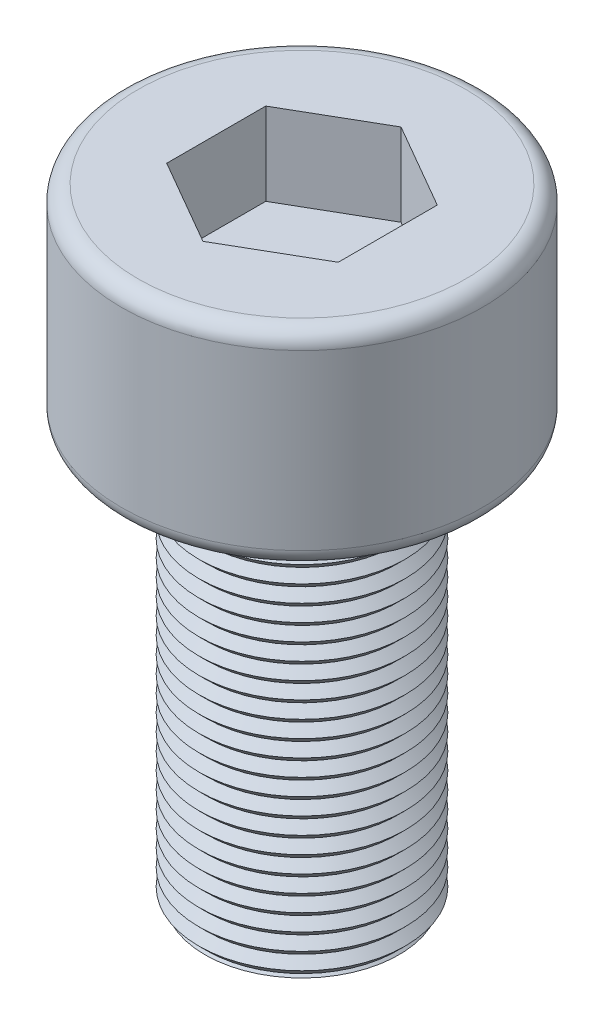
ISO-10303-21;
HEADER;
FILE_DESCRIPTION(('STEP AP214'),'2;1');
FILE_NAME('part.step','',(''),(''),'','','');
FILE_SCHEMA(('AUTOMOTIVE_DESIGN { 1 0 10303 214 1 1 1 1 }'));
ENDSEC;
DATA;
#1=APPLICATION_CONTEXT('core data for automotive mechanical design processes');
#2=APPLICATION_PROTOCOL_DEFINITION('international standard','automotive_design',2000,#1);
#3=PRODUCT_CONTEXT('',#1,'mechanical');
#4=PRODUCT('Part','Part','',(#3));
#5=PRODUCT_RELATED_PRODUCT_CATEGORY('part','',(#4));
#6=PRODUCT_DEFINITION_FORMATION('','',#4);
#7=PRODUCT_DEFINITION_CONTEXT('part definition',#1,'design');
#8=PRODUCT_DEFINITION('design','',#6,#7);
#9=PRODUCT_DEFINITION_SHAPE('','',#8);
#10=(LENGTH_UNIT() NAMED_UNIT(*) SI_UNIT(.MILLI.,.METRE.));
#11=(NAMED_UNIT(*) PLANE_ANGLE_UNIT() SI_UNIT($,.RADIAN.));
#12=(NAMED_UNIT(*) SI_UNIT($,.STERADIAN.) SOLID_ANGLE_UNIT());
#13=UNCERTAINTY_MEASURE_WITH_UNIT(LENGTH_MEASURE(1.E-05),#10,'distance_accuracy_value','');
#14=(GEOMETRIC_REPRESENTATION_CONTEXT(3) GLOBAL_UNCERTAINTY_ASSIGNED_CONTEXT((#13)) GLOBAL_UNIT_ASSIGNED_CONTEXT((#10,
#11,#12)) REPRESENTATION_CONTEXT('',''));
#15=CARTESIAN_POINT('',(0.,0.,0.));
#16=DIRECTION('',(0.,0.,1.));
#17=DIRECTION('',(1.,0.,0.));
#18=AXIS2_PLACEMENT_3D('',#15,#16,#17);
#19=CARTESIAN_POINT('',(0.,6.34998730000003,0.));
#20=DIRECTION('',(0.,1.,0.));
#21=DIRECTION('',(0.,0.,1.));
#22=AXIS2_PLACEMENT_3D('',#19,#20,#21);
#23=PLANE('',#22);
#24=CARTESIAN_POINT('',(0.,6.34998730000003,0.));
#25=DIRECTION('',(0.,1.,0.));
#26=DIRECTION('',(0.,0.,1.));
#27=AXIS2_PLACEMENT_3D('',#24,#25,#26);
#28=CIRCLE('',#27,2.52411944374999);
#29=CARTESIAN_POINT('',(0.,6.34998730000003,2.52411944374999));
#30=VERTEX_POINT('',#29);
#31=EDGE_CURVE('E46',#30,#30,#28,.F.);
#32=ORIENTED_EDGE('',*,*,#31,.T.);
#33=EDGE_LOOP('',(#32));
#34=FACE_BOUND('',#33,.T.);
#35=CARTESIAN_POINT('',(0.,6.34998730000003,0.));
#36=DIRECTION('',(0.,1.,0.));
#37=DIRECTION('',(0.,0.,1.));
#38=AXIS2_PLACEMENT_3D('',#35,#36,#37);
#39=CIRCLE('',#38,1.45860790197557);
#40=CARTESIAN_POINT('',(0.,6.34998730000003,1.45860790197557));
#41=VERTEX_POINT('',#40);
#42=EDGE_CURVE('E295',#41,#41,#39,.T.);
#43=ORIENTED_EDGE('',*,*,#42,.T.);
#44=EDGE_LOOP('',(#43));
#45=FACE_BOUND('',#44,.T.);
#46=ADVANCED_FACE('F38',(#34,#45),#23,.F.);
#47=CARTESIAN_POINT('',(0.,9.52498094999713,0.));
#48=DIRECTION('',(0.,1.,0.));
#49=DIRECTION('',(0.,0.,1.));
#50=AXIS2_PLACEMENT_3D('',#47,#48,#49);
#51=CYLINDRICAL_SURFACE('',#50,1.45860790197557);
#52=ORIENTED_EDGE('',*,*,#42,.F.);
#53=EDGE_LOOP('',(#52));
#54=FACE_BOUND('',#53,.T.);
#55=CARTESIAN_POINT('',(0.,6.22109837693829,0.));
#56=DIRECTION('',(0.,1.,0.));
#57=DIRECTION('',(0.,0.,1.));
#58=AXIS2_PLACEMENT_3D('',#55,#56,#57);
#59=CIRCLE('',#58,1.45860790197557);
#60=CARTESIAN_POINT('',(0.,6.22109837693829,1.45860790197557));
#61=VERTEX_POINT('',#60);
#62=EDGE_CURVE('E292',#61,#61,#59,.T.);
#63=ORIENTED_EDGE('',*,*,#62,.T.);
#64=EDGE_LOOP('',(#63));
#65=FACE_BOUND('',#64,.T.);
#66=ADVANCED_FACE('F344',(#54,#65),#51,.T.);
#67=CARTESIAN_POINT('',(0.,6.09220945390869,0.));
#68=DIRECTION('',(0.,-1.,0.));
#69=DIRECTION('',(0.,0.,-1.));
#70=AXIS2_PLACEMENT_3D('',#67,#68,#69);
#71=CONICAL_SURFACE('',#70,1.58749682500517,0.78539816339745);
#72=ORIENTED_EDGE('',*,*,#62,.F.);
#73=EDGE_LOOP('',(#72));
#74=FACE_BOUND('',#73,.T.);
#75=CARTESIAN_POINT('',(0.,6.09220945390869,0.));
#76=DIRECTION('',(0.,1.,0.));
#77=DIRECTION('',(0.,0.,1.));
#78=AXIS2_PLACEMENT_3D('',#75,#76,#77);
#79=CIRCLE('',#78,1.58749682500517);
#80=CARTESIAN_POINT('',(0.,6.09220945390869,1.58749682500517));
#81=VERTEX_POINT('',#80);
#82=EDGE_CURVE('E289',#81,#81,#79,.T.);
#83=ORIENTED_EDGE('',*,*,#82,.T.);
#84=EDGE_LOOP('',(#83));
#85=FACE_BOUND('',#84,.T.);
#86=ADVANCED_FACE('F349',(#74,#85),#71,.T.);
#87=CARTESIAN_POINT('',(0.,5.96332053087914,0.));
#88=DIRECTION('',(0.,1.,0.));
#89=DIRECTION('',(0.,0.,1.));
#90=AXIS2_PLACEMENT_3D('',#87,#88,#89);
#91=CONICAL_SURFACE('',#90,1.45860790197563,0.785398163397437);
#92=ORIENTED_EDGE('',*,*,#82,.F.);
#93=EDGE_LOOP('',(#92));
#94=FACE_BOUND('',#93,.T.);
#95=CARTESIAN_POINT('',(0.,5.96332053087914,0.));
#96=DIRECTION('',(0.,1.,0.));
#97=DIRECTION('',(0.,0.,1.));
#98=AXIS2_PLACEMENT_3D('',#95,#96,#97);
#99=CIRCLE('',#98,1.45860790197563);
#100=CARTESIAN_POINT('',(0.,5.96332053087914,1.45860790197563));
#101=VERTEX_POINT('',#100);
#102=EDGE_CURVE('E286',#101,#101,#99,.T.);
#103=ORIENTED_EDGE('',*,*,#102,.T.);
#104=EDGE_LOOP('',(#103));
#105=FACE_BOUND('',#104,.T.);
#106=ADVANCED_FACE('F355',(#94,#105),#91,.T.);
#107=CARTESIAN_POINT('',(0.,5.8344316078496,0.));
#108=DIRECTION('',(0.,-1.,0.));
#109=DIRECTION('',(0.,0.,-1.));
#110=AXIS2_PLACEMENT_3D('',#107,#108,#109);
#111=CONICAL_SURFACE('',#110,1.58749682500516,0.785398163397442);
#112=ORIENTED_EDGE('',*,*,#102,.F.);
#113=EDGE_LOOP('',(#112));
#114=FACE_BOUND('',#113,.T.);
#115=CARTESIAN_POINT('',(0.,5.8344316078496,0.));
#116=DIRECTION('',(0.,1.,0.));
#117=DIRECTION('',(0.,0.,1.));
#118=AXIS2_PLACEMENT_3D('',#115,#116,#117);
#119=CIRCLE('',#118,1.58749682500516);
#120=CARTESIAN_POINT('',(0.,5.8344316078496,1.58749682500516));
#121=VERTEX_POINT('',#120);
#122=EDGE_CURVE('E283',#121,#121,#119,.T.);
#123=ORIENTED_EDGE('',*,*,#122,.T.);
#124=EDGE_LOOP('',(#123));
#125=FACE_BOUND('',#124,.T.);
#126=ADVANCED_FACE('F359',(#114,#125),#111,.T.);
#127=CARTESIAN_POINT('',(0.,5.70554268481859,0.));
#128=DIRECTION('',(0.,1.,0.));
#129=DIRECTION('',(0.,0.,1.));
#130=AXIS2_PLACEMENT_3D('',#127,#128,#129);
#131=CONICAL_SURFACE('',#130,1.45860790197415,0.78539816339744);
#132=ORIENTED_EDGE('',*,*,#122,.F.);
#133=EDGE_LOOP('',(#132));
#134=FACE_BOUND('',#133,.T.);
#135=CARTESIAN_POINT('',(0.,5.70554268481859,0.));
#136=DIRECTION('',(0.,1.,0.));
#137=DIRECTION('',(0.,0.,1.));
#138=AXIS2_PLACEMENT_3D('',#135,#136,#137);
#139=CIRCLE('',#138,1.45860790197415);
#140=CARTESIAN_POINT('',(0.,5.70554268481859,1.45860790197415));
#141=VERTEX_POINT('',#140);
#142=EDGE_CURVE('E280',#141,#141,#139,.T.);
#143=ORIENTED_EDGE('',*,*,#142,.T.);
#144=EDGE_LOOP('',(#143));
#145=FACE_BOUND('',#144,.T.);
#146=ADVANCED_FACE('F363',(#134,#145),#131,.T.);
#147=CARTESIAN_POINT('',(0.,5.57665376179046,0.));
#148=DIRECTION('',(0.,-1.,0.));
#149=DIRECTION('',(0.,0.,-1.));
#150=AXIS2_PLACEMENT_3D('',#147,#148,#149);
#151=CONICAL_SURFACE('',#150,1.58749682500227,0.785398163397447);
#152=ORIENTED_EDGE('',*,*,#142,.F.);
#153=EDGE_LOOP('',(#152));
#154=FACE_BOUND('',#153,.T.);
#155=CARTESIAN_POINT('',(0.,5.57665376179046,0.));
#156=DIRECTION('',(0.,1.,0.));
#157=DIRECTION('',(0.,0.,1.));
#158=AXIS2_PLACEMENT_3D('',#155,#156,#157);
#159=CIRCLE('',#158,1.58749682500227);
#160=CARTESIAN_POINT('',(0.,5.57665376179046,1.58749682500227));
#161=VERTEX_POINT('',#160);
#162=EDGE_CURVE('E277',#161,#161,#159,.T.);
#163=ORIENTED_EDGE('',*,*,#162,.T.);
#164=EDGE_LOOP('',(#163));
#165=FACE_BOUND('',#164,.T.);
#166=ADVANCED_FACE('F367',(#154,#165),#151,.T.);
#167=CARTESIAN_POINT('',(0.,5.4477648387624,0.));
#168=DIRECTION('',(0.,1.,0.));
#169=DIRECTION('',(0.,0.,1.));
#170=AXIS2_PLACEMENT_3D('',#167,#168,#169);
#171=CONICAL_SURFACE('',#170,1.4586079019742,0.785398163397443);
#172=ORIENTED_EDGE('',*,*,#162,.F.);
#173=EDGE_LOOP('',(#172));
#174=FACE_BOUND('',#173,.T.);
#175=CARTESIAN_POINT('',(0.,5.4477648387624,0.));
#176=DIRECTION('',(0.,1.,0.));
#177=DIRECTION('',(0.,0.,1.));
#178=AXIS2_PLACEMENT_3D('',#175,#176,#177);
#179=CIRCLE('',#178,1.4586079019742);
#180=CARTESIAN_POINT('',(0.,5.4477648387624,1.4586079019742));
#181=VERTEX_POINT('',#180);
#182=EDGE_CURVE('E274',#181,#181,#179,.T.);
#183=ORIENTED_EDGE('',*,*,#182,.T.);
#184=EDGE_LOOP('',(#183));
#185=FACE_BOUND('',#184,.T.);
#186=ADVANCED_FACE('F371',(#174,#185),#171,.T.);
#187=CARTESIAN_POINT('',(0.,5.31887591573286,0.));
#188=DIRECTION('',(0.,-1.,0.));
#189=DIRECTION('',(0.,0.,-1.));
#190=AXIS2_PLACEMENT_3D('',#187,#188,#189);
#191=CONICAL_SURFACE('',#190,1.58749682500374,0.78539816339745);
#192=ORIENTED_EDGE('',*,*,#182,.F.);
#193=EDGE_LOOP('',(#192));
#194=FACE_BOUND('',#193,.T.);
#195=CARTESIAN_POINT('',(0.,5.31887591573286,0.));
#196=DIRECTION('',(0.,1.,0.));
#197=DIRECTION('',(0.,0.,1.));
#198=AXIS2_PLACEMENT_3D('',#195,#196,#197);
#199=CIRCLE('',#198,1.58749682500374);
#200=CARTESIAN_POINT('',(0.,5.31887591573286,1.58749682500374));
#201=VERTEX_POINT('',#200);
#202=EDGE_CURVE('E271',#201,#201,#199,.T.);
#203=ORIENTED_EDGE('',*,*,#202,.T.);
#204=EDGE_LOOP('',(#203));
#205=FACE_BOUND('',#204,.T.);
#206=ADVANCED_FACE('F375',(#194,#205),#191,.T.);
#207=CARTESIAN_POINT('',(0.,5.18998699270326,0.));
#208=DIRECTION('',(0.,1.,0.));
#209=DIRECTION('',(0.,0.,1.));
#210=AXIS2_PLACEMENT_3D('',#207,#208,#209);
#211=CONICAL_SURFACE('',#210,1.45860790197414,0.785398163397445);
#212=ORIENTED_EDGE('',*,*,#202,.F.);
#213=EDGE_LOOP('',(#212));
#214=FACE_BOUND('',#213,.T.);
#215=CARTESIAN_POINT('',(0.,5.18998699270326,0.));
#216=DIRECTION('',(0.,1.,0.));
#217=DIRECTION('',(0.,0.,1.));
#218=AXIS2_PLACEMENT_3D('',#215,#216,#217);
#219=CIRCLE('',#218,1.45860790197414);
#220=CARTESIAN_POINT('',(0.,5.18998699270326,1.45860790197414));
#221=VERTEX_POINT('',#220);
#222=EDGE_CURVE('E268',#221,#221,#219,.T.);
#223=ORIENTED_EDGE('',*,*,#222,.T.);
#224=EDGE_LOOP('',(#223));
#225=FACE_BOUND('',#224,.T.);
#226=ADVANCED_FACE('F379',(#214,#225),#211,.T.);
#227=CARTESIAN_POINT('',(0.,5.06109806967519,0.));
#228=DIRECTION('',(0.,-1.,0.));
#229=DIRECTION('',(0.,0.,-1.));
#230=AXIS2_PLACEMENT_3D('',#227,#228,#229);
#231=CONICAL_SURFACE('',#230,1.58749682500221,0.785398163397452);
#232=ORIENTED_EDGE('',*,*,#222,.F.);
#233=EDGE_LOOP('',(#232));
#234=FACE_BOUND('',#233,.T.);
#235=CARTESIAN_POINT('',(0.,5.06109806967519,0.));
#236=DIRECTION('',(0.,1.,0.));
#237=DIRECTION('',(0.,0.,1.));
#238=AXIS2_PLACEMENT_3D('',#235,#236,#237);
#239=CIRCLE('',#238,1.58749682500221);
#240=CARTESIAN_POINT('',(0.,5.06109806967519,1.58749682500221));
#241=VERTEX_POINT('',#240);
#242=EDGE_CURVE('E265',#241,#241,#239,.T.);
#243=ORIENTED_EDGE('',*,*,#242,.T.);
#244=EDGE_LOOP('',(#243));
#245=FACE_BOUND('',#244,.T.);
#246=ADVANCED_FACE('F383',(#234,#245),#231,.T.);
#247=CARTESIAN_POINT('',(0.,4.93220914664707,0.));
#248=DIRECTION('',(0.,1.,0.));
#249=DIRECTION('',(0.,0.,1.));
#250=AXIS2_PLACEMENT_3D('',#247,#248,#249);
#251=CONICAL_SURFACE('',#250,1.45860790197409,0.785398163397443);
#252=ORIENTED_EDGE('',*,*,#242,.F.);
#253=EDGE_LOOP('',(#252));
#254=FACE_BOUND('',#253,.T.);
#255=CARTESIAN_POINT('',(0.,4.93220914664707,0.));
#256=DIRECTION('',(0.,1.,0.));
#257=DIRECTION('',(0.,0.,1.));
#258=AXIS2_PLACEMENT_3D('',#255,#256,#257);
#259=CIRCLE('',#258,1.45860790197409);
#260=CARTESIAN_POINT('',(0.,4.93220914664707,1.45860790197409));
#261=VERTEX_POINT('',#260);
#262=EDGE_CURVE('E262',#261,#261,#259,.T.);
#263=ORIENTED_EDGE('',*,*,#262,.T.);
#264=EDGE_LOOP('',(#263));
#265=FACE_BOUND('',#264,.T.);
#266=ADVANCED_FACE('F387',(#254,#265),#251,.T.);
#267=CARTESIAN_POINT('',(0.,4.80332022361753,0.));
#268=DIRECTION('',(0.,-1.,0.));
#269=DIRECTION('',(0.,0.,-1.));
#270=AXIS2_PLACEMENT_3D('',#267,#268,#269);
#271=CONICAL_SURFACE('',#270,1.58749682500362,0.785398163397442);
#272=ORIENTED_EDGE('',*,*,#262,.F.);
#273=EDGE_LOOP('',(#272));
#274=FACE_BOUND('',#273,.T.);
#275=CARTESIAN_POINT('',(0.,4.80332022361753,0.));
#276=DIRECTION('',(0.,1.,0.));
#277=DIRECTION('',(0.,0.,1.));
#278=AXIS2_PLACEMENT_3D('',#275,#276,#277);
#279=CIRCLE('',#278,1.58749682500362);
#280=CARTESIAN_POINT('',(0.,4.80332022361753,1.58749682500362));
#281=VERTEX_POINT('',#280);
#282=EDGE_CURVE('E259',#281,#281,#279,.T.);
#283=ORIENTED_EDGE('',*,*,#282,.T.);
#284=EDGE_LOOP('',(#283));
#285=FACE_BOUND('',#284,.T.);
#286=ADVANCED_FACE('F391',(#274,#285),#271,.T.);
#287=CARTESIAN_POINT('',(0.,4.67443130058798,0.));
#288=DIRECTION('',(0.,1.,0.));
#289=DIRECTION('',(0.,0.,1.));
#290=AXIS2_PLACEMENT_3D('',#287,#288,#289);
#291=CONICAL_SURFACE('',#290,1.45860790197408,0.785398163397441);
#292=ORIENTED_EDGE('',*,*,#282,.F.);
#293=EDGE_LOOP('',(#292));
#294=FACE_BOUND('',#293,.T.);
#295=CARTESIAN_POINT('',(0.,4.67443130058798,0.));
#296=DIRECTION('',(0.,1.,0.));
#297=DIRECTION('',(0.,0.,1.));
#298=AXIS2_PLACEMENT_3D('',#295,#296,#297);
#299=CIRCLE('',#298,1.45860790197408);
#300=CARTESIAN_POINT('',(0.,4.67443130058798,1.45860790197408));
#301=VERTEX_POINT('',#300);
#302=EDGE_CURVE('E256',#301,#301,#299,.T.);
#303=ORIENTED_EDGE('',*,*,#302,.T.);
#304=EDGE_LOOP('',(#303));
#305=FACE_BOUND('',#304,.T.);
#306=ADVANCED_FACE('F395',(#294,#305),#291,.T.);
#307=CARTESIAN_POINT('',(0.,4.54554237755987,0.));
#308=DIRECTION('',(0.,-1.,0.));
#309=DIRECTION('',(0.,0.,-1.));
#310=AXIS2_PLACEMENT_3D('',#307,#308,#309);
#311=CONICAL_SURFACE('',#310,1.5874968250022,0.785398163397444);
#312=ORIENTED_EDGE('',*,*,#302,.F.);
#313=EDGE_LOOP('',(#312));
#314=FACE_BOUND('',#313,.T.);
#315=CARTESIAN_POINT('',(0.,4.54554237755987,0.));
#316=DIRECTION('',(0.,1.,0.));
#317=DIRECTION('',(0.,0.,1.));
#318=AXIS2_PLACEMENT_3D('',#315,#316,#317);
#319=CIRCLE('',#318,1.5874968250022);
#320=CARTESIAN_POINT('',(0.,4.54554237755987,1.5874968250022));
#321=VERTEX_POINT('',#320);
#322=EDGE_CURVE('E253',#321,#321,#319,.T.);
#323=ORIENTED_EDGE('',*,*,#322,.T.);
#324=EDGE_LOOP('',(#323));
#325=FACE_BOUND('',#324,.T.);
#326=ADVANCED_FACE('F399',(#314,#325),#311,.T.);
#327=CARTESIAN_POINT('',(0.,4.4166534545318,0.));
#328=DIRECTION('',(0.,1.,0.));
#329=DIRECTION('',(0.,0.,1.));
#330=AXIS2_PLACEMENT_3D('',#327,#328,#329);
#331=CONICAL_SURFACE('',#330,1.45860790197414,0.785398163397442);
#332=ORIENTED_EDGE('',*,*,#322,.F.);
#333=EDGE_LOOP('',(#332));
#334=FACE_BOUND('',#333,.T.);
#335=CARTESIAN_POINT('',(0.,4.4166534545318,0.));
#336=DIRECTION('',(0.,1.,0.));
#337=DIRECTION('',(0.,0.,1.));
#338=AXIS2_PLACEMENT_3D('',#335,#336,#337);
#339=CIRCLE('',#338,1.45860790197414);
#340=CARTESIAN_POINT('',(0.,4.4166534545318,1.45860790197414));
#341=VERTEX_POINT('',#340);
#342=EDGE_CURVE('E250',#341,#341,#339,.T.);
#343=ORIENTED_EDGE('',*,*,#342,.T.);
#344=EDGE_LOOP('',(#343));
#345=FACE_BOUND('',#344,.T.);
#346=ADVANCED_FACE('F403',(#334,#345),#331,.T.);
#347=CARTESIAN_POINT('',(0.,4.28776453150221,0.));
#348=DIRECTION('',(0.,-1.,0.));
#349=DIRECTION('',(0.,0.,-1.));
#350=AXIS2_PLACEMENT_3D('',#347,#348,#349);
#351=CONICAL_SURFACE('',#350,1.58749682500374,0.78539816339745);
#352=ORIENTED_EDGE('',*,*,#342,.F.);
#353=EDGE_LOOP('',(#352));
#354=FACE_BOUND('',#353,.T.);
#355=CARTESIAN_POINT('',(0.,4.28776453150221,0.));
#356=DIRECTION('',(0.,1.,0.));
#357=DIRECTION('',(0.,0.,1.));
#358=AXIS2_PLACEMENT_3D('',#355,#356,#357);
#359=CIRCLE('',#358,1.58749682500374);
#360=CARTESIAN_POINT('',(0.,4.28776453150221,1.58749682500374));
#361=VERTEX_POINT('',#360);
#362=EDGE_CURVE('E247',#361,#361,#359,.T.);
#363=ORIENTED_EDGE('',*,*,#362,.T.);
#364=EDGE_LOOP('',(#363));
#365=FACE_BOUND('',#364,.T.);
#366=ADVANCED_FACE('F407',(#354,#365),#351,.T.);
#367=CARTESIAN_POINT('',(0.,4.15887560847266,0.));
#368=DIRECTION('',(0.,1.,0.));
#369=DIRECTION('',(0.,0.,1.));
#370=AXIS2_PLACEMENT_3D('',#367,#368,#369);
#371=CONICAL_SURFACE('',#370,1.45860790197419,0.785398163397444);
#372=ORIENTED_EDGE('',*,*,#362,.F.);
#373=EDGE_LOOP('',(#372));
#374=FACE_BOUND('',#373,.T.);
#375=CARTESIAN_POINT('',(0.,4.15887560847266,0.));
#376=DIRECTION('',(0.,1.,0.));
#377=DIRECTION('',(0.,0.,1.));
#378=AXIS2_PLACEMENT_3D('',#375,#376,#377);
#379=CIRCLE('',#378,1.45860790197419);
#380=CARTESIAN_POINT('',(0.,4.15887560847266,1.45860790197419));
#381=VERTEX_POINT('',#380);
#382=EDGE_CURVE('E244',#381,#381,#379,.T.);
#383=ORIENTED_EDGE('',*,*,#382,.T.);
#384=EDGE_LOOP('',(#383));
#385=FACE_BOUND('',#384,.T.);
#386=ADVANCED_FACE('F411',(#374,#385),#371,.T.);
#387=CARTESIAN_POINT('',(0.,4.0299866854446,0.));
#388=DIRECTION('',(0.,-1.,0.));
#389=DIRECTION('',(0.,0.,-1.));
#390=AXIS2_PLACEMENT_3D('',#387,#388,#389);
#391=CONICAL_SURFACE('',#390,1.58749682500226,0.78539816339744);
#392=ORIENTED_EDGE('',*,*,#382,.F.);
#393=EDGE_LOOP('',(#392));
#394=FACE_BOUND('',#393,.T.);
#395=CARTESIAN_POINT('',(0.,4.0299866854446,0.));
#396=DIRECTION('',(0.,1.,0.));
#397=DIRECTION('',(0.,0.,1.));
#398=AXIS2_PLACEMENT_3D('',#395,#396,#397);
#399=CIRCLE('',#398,1.58749682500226);
#400=CARTESIAN_POINT('',(0.,4.0299866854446,1.58749682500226));
#401=VERTEX_POINT('',#400);
#402=EDGE_CURVE('E241',#401,#401,#399,.T.);
#403=ORIENTED_EDGE('',*,*,#402,.T.);
#404=EDGE_LOOP('',(#403));
#405=FACE_BOUND('',#404,.T.);
#406=ADVANCED_FACE('F415',(#394,#405),#391,.T.);
#407=CARTESIAN_POINT('',(0.,3.90109776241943,0.));
#408=DIRECTION('',(0.,1.,0.));
#409=DIRECTION('',(0.,0.,1.));
#410=AXIS2_PLACEMENT_3D('',#407,#408,#409);
#411=CONICAL_SURFACE('',#410,1.45860790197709,0.785398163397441);
#412=ORIENTED_EDGE('',*,*,#402,.F.);
#413=EDGE_LOOP('',(#412));
#414=FACE_BOUND('',#413,.T.);
#415=CARTESIAN_POINT('',(0.,3.90109776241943,0.));
#416=DIRECTION('',(0.,1.,0.));
#417=DIRECTION('',(0.,0.,1.));
#418=AXIS2_PLACEMENT_3D('',#415,#416,#417);
#419=CIRCLE('',#418,1.45860790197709);
#420=CARTESIAN_POINT('',(0.,3.90109776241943,1.45860790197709));
#421=VERTEX_POINT('',#420);
#422=EDGE_CURVE('E238',#421,#421,#419,.T.);
#423=ORIENTED_EDGE('',*,*,#422,.T.);
#424=EDGE_LOOP('',(#423));
#425=FACE_BOUND('',#424,.T.);
#426=ADVANCED_FACE('F419',(#414,#425),#411,.T.);
#427=CARTESIAN_POINT('',(0.,3.77220883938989,0.));
#428=DIRECTION('',(0.,-1.,0.));
#429=DIRECTION('',(0.,0.,-1.));
#430=AXIS2_PLACEMENT_3D('',#427,#428,#429);
#431=CONICAL_SURFACE('',#430,1.58749682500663,0.785398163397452);
#432=ORIENTED_EDGE('',*,*,#422,.F.);
#433=EDGE_LOOP('',(#432));
#434=FACE_BOUND('',#433,.T.);
#435=CARTESIAN_POINT('',(0.,3.77220883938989,0.));
#436=DIRECTION('',(0.,1.,0.));
#437=DIRECTION('',(0.,0.,1.));
#438=AXIS2_PLACEMENT_3D('',#435,#436,#437);
#439=CIRCLE('',#438,1.58749682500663);
#440=CARTESIAN_POINT('',(0.,3.77220883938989,1.58749682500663));
#441=VERTEX_POINT('',#440);
#442=EDGE_CURVE('E235',#441,#441,#439,.T.);
#443=ORIENTED_EDGE('',*,*,#442,.T.);
#444=EDGE_LOOP('',(#443));
#445=FACE_BOUND('',#444,.T.);
#446=ADVANCED_FACE('F423',(#434,#445),#431,.T.);
#447=CARTESIAN_POINT('',(0.,3.6433199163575,0.));
#448=DIRECTION('',(0.,1.,0.));
#449=DIRECTION('',(0.,0.,1.));
#450=AXIS2_PLACEMENT_3D('',#447,#448,#449);
#451=CONICAL_SURFACE('',#450,1.45860790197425,0.785398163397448);
#452=ORIENTED_EDGE('',*,*,#442,.F.);
#453=EDGE_LOOP('',(#452));
#454=FACE_BOUND('',#453,.T.);
#455=CARTESIAN_POINT('',(0.,3.6433199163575,0.));
#456=DIRECTION('',(0.,1.,0.));
#457=DIRECTION('',(0.,0.,1.));
#458=AXIS2_PLACEMENT_3D('',#455,#456,#457);
#459=CIRCLE('',#458,1.45860790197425);
#460=CARTESIAN_POINT('',(0.,3.6433199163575,1.45860790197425));
#461=VERTEX_POINT('',#460);
#462=EDGE_CURVE('E232',#461,#461,#459,.T.);
#463=ORIENTED_EDGE('',*,*,#462,.T.);
#464=EDGE_LOOP('',(#463));
#465=FACE_BOUND('',#464,.T.);
#466=ADVANCED_FACE('F427',(#454,#465),#451,.T.);
#467=CARTESIAN_POINT('',(0.,3.51443099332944,0.));
#468=DIRECTION('',(0.,-1.,0.));
#469=DIRECTION('',(0.,0.,-1.));
#470=AXIS2_PLACEMENT_3D('',#467,#468,#469);
#471=CONICAL_SURFACE('',#470,1.58749682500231,0.785398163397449);
#472=ORIENTED_EDGE('',*,*,#462,.F.);
#473=EDGE_LOOP('',(#472));
#474=FACE_BOUND('',#473,.T.);
#475=CARTESIAN_POINT('',(0.,3.51443099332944,0.));
#476=DIRECTION('',(0.,1.,0.));
#477=DIRECTION('',(0.,0.,1.));
#478=AXIS2_PLACEMENT_3D('',#475,#476,#477);
#479=CIRCLE('',#478,1.58749682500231);
#480=CARTESIAN_POINT('',(0.,3.51443099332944,1.58749682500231));
#481=VERTEX_POINT('',#480);
#482=EDGE_CURVE('E229',#481,#481,#479,.T.);
#483=ORIENTED_EDGE('',*,*,#482,.T.);
#484=EDGE_LOOP('',(#483));
#485=FACE_BOUND('',#484,.T.);
#486=ADVANCED_FACE('F431',(#474,#485),#471,.T.);
#487=CARTESIAN_POINT('',(0.,3.3855420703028,0.));
#488=DIRECTION('',(0.,1.,0.));
#489=DIRECTION('',(0.,0.,1.));
#490=AXIS2_PLACEMENT_3D('',#487,#488,#489);
#491=CONICAL_SURFACE('',#490,1.45860790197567,0.785398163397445);
#492=ORIENTED_EDGE('',*,*,#482,.F.);
#493=EDGE_LOOP('',(#492));
#494=FACE_BOUND('',#493,.T.);
#495=CARTESIAN_POINT('',(0.,3.3855420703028,0.));
#496=DIRECTION('',(0.,1.,0.));
#497=DIRECTION('',(0.,0.,1.));
#498=AXIS2_PLACEMENT_3D('',#495,#496,#497);
#499=CIRCLE('',#498,1.45860790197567);
#500=CARTESIAN_POINT('',(0.,3.3855420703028,1.45860790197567));
#501=VERTEX_POINT('',#500);
#502=EDGE_CURVE('E226',#501,#501,#499,.T.);
#503=ORIENTED_EDGE('',*,*,#502,.T.);
#504=EDGE_LOOP('',(#503));
#505=FACE_BOUND('',#504,.T.);
#506=ADVANCED_FACE('F435',(#494,#505),#491,.T.);
#507=CARTESIAN_POINT('',(0.,3.25665314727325,0.));
#508=DIRECTION('',(0.,-1.,0.));
#509=DIRECTION('',(0.,0.,-1.));
#510=AXIS2_PLACEMENT_3D('',#507,#508,#509);
#511=CONICAL_SURFACE('',#510,1.58749682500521,0.78539816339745);
#512=ORIENTED_EDGE('',*,*,#502,.F.);
#513=EDGE_LOOP('',(#512));
#514=FACE_BOUND('',#513,.T.);
#515=CARTESIAN_POINT('',(0.,3.25665314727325,0.));
#516=DIRECTION('',(0.,1.,0.));
#517=DIRECTION('',(0.,0.,1.));
#518=AXIS2_PLACEMENT_3D('',#515,#516,#517);
#519=CIRCLE('',#518,1.58749682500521);
#520=CARTESIAN_POINT('',(0.,3.25665314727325,1.58749682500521));
#521=VERTEX_POINT('',#520);
#522=EDGE_CURVE('E223',#521,#521,#519,.T.);
#523=ORIENTED_EDGE('',*,*,#522,.T.);
#524=EDGE_LOOP('',(#523));
#525=FACE_BOUND('',#524,.T.);
#526=ADVANCED_FACE('F439',(#514,#525),#511,.T.);
#527=CARTESIAN_POINT('',(0.,3.12776422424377,0.));
#528=DIRECTION('',(0.,1.,0.));
#529=DIRECTION('',(0.,0.,1.));
#530=AXIS2_PLACEMENT_3D('',#527,#528,#529);
#531=CONICAL_SURFACE('',#530,1.45860790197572,0.785398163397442);
#532=ORIENTED_EDGE('',*,*,#522,.F.);
#533=EDGE_LOOP('',(#532));
#534=FACE_BOUND('',#533,.T.);
#535=CARTESIAN_POINT('',(0.,3.12776422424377,0.));
#536=DIRECTION('',(0.,1.,0.));
#537=DIRECTION('',(0.,0.,1.));
#538=AXIS2_PLACEMENT_3D('',#535,#536,#537);
#539=CIRCLE('',#538,1.45860790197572);
#540=CARTESIAN_POINT('',(0.,3.12776422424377,1.45860790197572));
#541=VERTEX_POINT('',#540);
#542=EDGE_CURVE('E220',#541,#541,#539,.T.);
#543=ORIENTED_EDGE('',*,*,#542,.T.);
#544=EDGE_LOOP('',(#543));
#545=FACE_BOUND('',#544,.T.);
#546=ADVANCED_FACE('F443',(#534,#545),#531,.T.);
#547=CARTESIAN_POINT('',(0.,2.99887530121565,0.));
#548=DIRECTION('',(0.,-1.,0.));
#549=DIRECTION('',(0.,0.,-1.));
#550=AXIS2_PLACEMENT_3D('',#547,#548,#549);
#551=CONICAL_SURFACE('',#550,1.58749682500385,0.78539816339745);
#552=ORIENTED_EDGE('',*,*,#542,.F.);
#553=EDGE_LOOP('',(#552));
#554=FACE_BOUND('',#553,.T.);
#555=CARTESIAN_POINT('',(0.,2.99887530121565,0.));
#556=DIRECTION('',(0.,1.,0.));
#557=DIRECTION('',(0.,0.,1.));
#558=AXIS2_PLACEMENT_3D('',#555,#556,#557);
#559=CIRCLE('',#558,1.58749682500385);
#560=CARTESIAN_POINT('',(0.,2.99887530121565,1.58749682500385));
#561=VERTEX_POINT('',#560);
#562=EDGE_CURVE('E217',#561,#561,#559,.T.);
#563=ORIENTED_EDGE('',*,*,#562,.T.);
#564=EDGE_LOOP('',(#563));
#565=FACE_BOUND('',#564,.T.);
#566=ADVANCED_FACE('F447',(#554,#565),#551,.T.);
#567=CARTESIAN_POINT('',(0.,2.86998637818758,0.));
#568=DIRECTION('',(0.,1.,0.));
#569=DIRECTION('',(0.,0.,1.));
#570=AXIS2_PLACEMENT_3D('',#567,#568,#569);
#571=CONICAL_SURFACE('',#570,1.45860790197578,0.785398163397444);
#572=ORIENTED_EDGE('',*,*,#562,.F.);
#573=EDGE_LOOP('',(#572));
#574=FACE_BOUND('',#573,.T.);
#575=CARTESIAN_POINT('',(0.,2.86998637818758,0.));
#576=DIRECTION('',(0.,1.,0.));
#577=DIRECTION('',(0.,0.,1.));
#578=AXIS2_PLACEMENT_3D('',#575,#576,#577);
#579=CIRCLE('',#578,1.45860790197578);
#580=CARTESIAN_POINT('',(0.,2.86998637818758,1.45860790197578));
#581=VERTEX_POINT('',#580);
#582=EDGE_CURVE('E214',#581,#581,#579,.T.);
#583=ORIENTED_EDGE('',*,*,#582,.T.);
#584=EDGE_LOOP('',(#583));
#585=FACE_BOUND('',#584,.T.);
#586=ADVANCED_FACE('F451',(#574,#585),#571,.T.);
#587=CARTESIAN_POINT('',(0.,2.7410974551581,0.));
#588=DIRECTION('',(0.,-1.,0.));
#589=DIRECTION('',(0.,0.,-1.));
#590=AXIS2_PLACEMENT_3D('',#587,#588,#589);
#591=CONICAL_SURFACE('',#590,1.58749682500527,0.785398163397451);
#592=ORIENTED_EDGE('',*,*,#582,.F.);
#593=EDGE_LOOP('',(#592));
#594=FACE_BOUND('',#593,.T.);
#595=CARTESIAN_POINT('',(0.,2.7410974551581,0.));
#596=DIRECTION('',(0.,1.,0.));
#597=DIRECTION('',(0.,0.,1.));
#598=AXIS2_PLACEMENT_3D('',#595,#596,#597);
#599=CIRCLE('',#598,1.58749682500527);
#600=CARTESIAN_POINT('',(0.,2.7410974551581,1.58749682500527));
#601=VERTEX_POINT('',#600);
#602=EDGE_CURVE('E211',#601,#601,#599,.T.);
#603=ORIENTED_EDGE('',*,*,#602,.T.);
#604=EDGE_LOOP('',(#603));
#605=FACE_BOUND('',#604,.T.);
#606=ADVANCED_FACE('F455',(#594,#605),#591,.T.);
#607=CARTESIAN_POINT('',(0.,2.61220853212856,0.));
#608=DIRECTION('',(0.,1.,0.));
#609=DIRECTION('',(0.,0.,1.));
#610=AXIS2_PLACEMENT_3D('',#607,#608,#609);
#611=CONICAL_SURFACE('',#610,1.45860790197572,0.78539816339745);
#612=ORIENTED_EDGE('',*,*,#602,.F.);
#613=EDGE_LOOP('',(#612));
#614=FACE_BOUND('',#613,.T.);
#615=CARTESIAN_POINT('',(0.,2.61220853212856,0.));
#616=DIRECTION('',(0.,1.,0.));
#617=DIRECTION('',(0.,0.,1.));
#618=AXIS2_PLACEMENT_3D('',#615,#616,#617);
#619=CIRCLE('',#618,1.45860790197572);
#620=CARTESIAN_POINT('',(0.,2.61220853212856,1.45860790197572));
#621=VERTEX_POINT('',#620);
#622=EDGE_CURVE('E208',#621,#621,#619,.T.);
#623=ORIENTED_EDGE('',*,*,#622,.T.);
#624=EDGE_LOOP('',(#623));
#625=FACE_BOUND('',#624,.T.);
#626=ADVANCED_FACE('F459',(#614,#625),#611,.T.);
#627=CARTESIAN_POINT('',(0.,2.48331960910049,0.));
#628=DIRECTION('',(0.,-1.,0.));
#629=DIRECTION('',(0.,0.,-1.));
#630=AXIS2_PLACEMENT_3D('',#627,#628,#629);
#631=CONICAL_SURFACE('',#630,1.58749682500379,0.785398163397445);
#632=ORIENTED_EDGE('',*,*,#622,.F.);
#633=EDGE_LOOP('',(#632));
#634=FACE_BOUND('',#633,.T.);
#635=CARTESIAN_POINT('',(0.,2.48331960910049,0.));
#636=DIRECTION('',(0.,1.,0.));
#637=DIRECTION('',(0.,0.,1.));
#638=AXIS2_PLACEMENT_3D('',#635,#636,#637);
#639=CIRCLE('',#638,1.58749682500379);
#640=CARTESIAN_POINT('',(0.,2.48331960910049,1.58749682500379));
#641=VERTEX_POINT('',#640);
#642=EDGE_CURVE('E205',#641,#641,#639,.T.);
#643=ORIENTED_EDGE('',*,*,#642,.T.);
#644=EDGE_LOOP('',(#643));
#645=FACE_BOUND('',#644,.T.);
#646=ADVANCED_FACE('F463',(#634,#645),#631,.T.);
#647=CARTESIAN_POINT('',(0.,2.35443068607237,0.));
#648=DIRECTION('',(0.,1.,0.));
#649=DIRECTION('',(0.,0.,1.));
#650=AXIS2_PLACEMENT_3D('',#647,#648,#649);
#651=CONICAL_SURFACE('',#650,1.45860790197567,0.785398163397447);
#652=ORIENTED_EDGE('',*,*,#642,.F.);
#653=EDGE_LOOP('',(#652));
#654=FACE_BOUND('',#653,.T.);
#655=CARTESIAN_POINT('',(0.,2.35443068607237,0.));
#656=DIRECTION('',(0.,1.,0.));
#657=DIRECTION('',(0.,0.,1.));
#658=AXIS2_PLACEMENT_3D('',#655,#656,#657);
#659=CIRCLE('',#658,1.45860790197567);
#660=CARTESIAN_POINT('',(0.,2.35443068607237,1.45860790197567));
#661=VERTEX_POINT('',#660);
#662=EDGE_CURVE('E202',#661,#661,#659,.T.);
#663=ORIENTED_EDGE('',*,*,#662,.T.);
#664=EDGE_LOOP('',(#663));
#665=FACE_BOUND('',#664,.T.);
#666=ADVANCED_FACE('F467',(#654,#665),#651,.T.);
#667=CARTESIAN_POINT('',(0.,2.22554176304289,0.));
#668=DIRECTION('',(0.,-1.,0.));
#669=DIRECTION('',(0.,0.,-1.));
#670=AXIS2_PLACEMENT_3D('',#667,#668,#669);
#671=CONICAL_SURFACE('',#670,1.58749682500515,0.785398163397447);
#672=ORIENTED_EDGE('',*,*,#662,.F.);
#673=EDGE_LOOP('',(#672));
#674=FACE_BOUND('',#673,.T.);
#675=CARTESIAN_POINT('',(0.,2.22554176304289,0.));
#676=DIRECTION('',(0.,1.,0.));
#677=DIRECTION('',(0.,0.,1.));
#678=AXIS2_PLACEMENT_3D('',#675,#676,#677);
#679=CIRCLE('',#678,1.58749682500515);
#680=CARTESIAN_POINT('',(0.,2.22554176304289,1.58749682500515));
#681=VERTEX_POINT('',#680);
#682=EDGE_CURVE('E199',#681,#681,#679,.T.);
#683=ORIENTED_EDGE('',*,*,#682,.T.);
#684=EDGE_LOOP('',(#683));
#685=FACE_BOUND('',#684,.T.);
#686=ADVANCED_FACE('F471',(#674,#685),#671,.T.);
#687=CARTESIAN_POINT('',(0.,2.0966528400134,0.));
#688=DIRECTION('',(0.,1.,0.));
#689=DIRECTION('',(0.,0.,1.));
#690=AXIS2_PLACEMENT_3D('',#687,#688,#689);
#691=CONICAL_SURFACE('',#690,1.45860790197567,0.785398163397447);
#692=ORIENTED_EDGE('',*,*,#682,.F.);
#693=EDGE_LOOP('',(#692));
#694=FACE_BOUND('',#693,.T.);
#695=CARTESIAN_POINT('',(0.,2.0966528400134,0.));
#696=DIRECTION('',(0.,1.,0.));
#697=DIRECTION('',(0.,0.,1.));
#698=AXIS2_PLACEMENT_3D('',#695,#696,#697);
#699=CIRCLE('',#698,1.45860790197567);
#700=CARTESIAN_POINT('',(0.,2.0966528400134,1.45860790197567));
#701=VERTEX_POINT('',#700);
#702=EDGE_CURVE('E196',#701,#701,#699,.T.);
#703=ORIENTED_EDGE('',*,*,#702,.T.);
#704=EDGE_LOOP('',(#703));
#705=FACE_BOUND('',#704,.T.);
#706=ADVANCED_FACE('F475',(#694,#705),#691,.T.);
#707=CARTESIAN_POINT('',(0.,1.96776391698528,0.));
#708=DIRECTION('',(0.,-1.,0.));
#709=DIRECTION('',(0.,0.,-1.));
#710=AXIS2_PLACEMENT_3D('',#707,#708,#709);
#711=CONICAL_SURFACE('',#710,1.58749682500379,0.785398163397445);
#712=ORIENTED_EDGE('',*,*,#702,.F.);
#713=EDGE_LOOP('',(#712));
#714=FACE_BOUND('',#713,.T.);
#715=CARTESIAN_POINT('',(0.,1.96776391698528,0.));
#716=DIRECTION('',(0.,1.,0.));
#717=DIRECTION('',(0.,0.,1.));
#718=AXIS2_PLACEMENT_3D('',#715,#716,#717);
#719=CIRCLE('',#718,1.58749682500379);
#720=CARTESIAN_POINT('',(0.,1.96776391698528,1.58749682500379));
#721=VERTEX_POINT('',#720);
#722=EDGE_CURVE('E193',#721,#721,#719,.T.);
#723=ORIENTED_EDGE('',*,*,#722,.T.);
#724=EDGE_LOOP('',(#723));
#725=FACE_BOUND('',#724,.T.);
#726=ADVANCED_FACE('F479',(#714,#725),#711,.T.);
#727=CARTESIAN_POINT('',(0.,1.83887499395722,0.));
#728=DIRECTION('',(0.,1.,0.));
#729=DIRECTION('',(0.,0.,1.));
#730=AXIS2_PLACEMENT_3D('',#727,#728,#729);
#731=CONICAL_SURFACE('',#730,1.45860790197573,0.785398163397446);
#732=ORIENTED_EDGE('',*,*,#722,.F.);
#733=EDGE_LOOP('',(#732));
#734=FACE_BOUND('',#733,.T.);
#735=CARTESIAN_POINT('',(0.,1.83887499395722,0.));
#736=DIRECTION('',(0.,1.,0.));
#737=DIRECTION('',(0.,0.,1.));
#738=AXIS2_PLACEMENT_3D('',#735,#736,#737);
#739=CIRCLE('',#738,1.45860790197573);
#740=CARTESIAN_POINT('',(0.,1.83887499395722,1.45860790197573));
#741=VERTEX_POINT('',#740);
#742=EDGE_CURVE('E190',#741,#741,#739,.T.);
#743=ORIENTED_EDGE('',*,*,#742,.T.);
#744=EDGE_LOOP('',(#743));
#745=FACE_BOUND('',#744,.T.);
#746=ADVANCED_FACE('F483',(#734,#745),#731,.T.);
#747=CARTESIAN_POINT('',(0.,1.70998607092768,0.));
#748=DIRECTION('',(0.,-1.,0.));
#749=DIRECTION('',(0.,0.,-1.));
#750=AXIS2_PLACEMENT_3D('',#747,#748,#749);
#751=CONICAL_SURFACE('',#750,1.58749682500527,0.785398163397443);
#752=ORIENTED_EDGE('',*,*,#742,.F.);
#753=EDGE_LOOP('',(#752));
#754=FACE_BOUND('',#753,.T.);
#755=CARTESIAN_POINT('',(0.,1.70998607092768,0.));
#756=DIRECTION('',(0.,1.,0.));
#757=DIRECTION('',(0.,0.,1.));
#758=AXIS2_PLACEMENT_3D('',#755,#756,#757);
#759=CIRCLE('',#758,1.58749682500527);
#760=CARTESIAN_POINT('',(0.,1.70998607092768,1.58749682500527));
#761=VERTEX_POINT('',#760);
#762=EDGE_CURVE('E187',#761,#761,#759,.T.);
#763=ORIENTED_EDGE('',*,*,#762,.T.);
#764=EDGE_LOOP('',(#763));
#765=FACE_BOUND('',#764,.T.);
#766=ADVANCED_FACE('F487',(#754,#765),#751,.T.);
#767=CARTESIAN_POINT('',(0.,1.58109714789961,0.));
#768=DIRECTION('',(0.,1.,0.));
#769=DIRECTION('',(0.,0.,1.));
#770=AXIS2_PLACEMENT_3D('',#767,#768,#769);
#771=CONICAL_SURFACE('',#770,1.45860790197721,0.785398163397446);
#772=ORIENTED_EDGE('',*,*,#762,.F.);
#773=EDGE_LOOP('',(#772));
#774=FACE_BOUND('',#773,.T.);
#775=CARTESIAN_POINT('',(0.,1.58109714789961,0.));
#776=DIRECTION('',(0.,1.,0.));
#777=DIRECTION('',(0.,0.,1.));
#778=AXIS2_PLACEMENT_3D('',#775,#776,#777);
#779=CIRCLE('',#778,1.45860790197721);
#780=CARTESIAN_POINT('',(0.,1.58109714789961,1.45860790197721));
#781=VERTEX_POINT('',#780);
#782=EDGE_CURVE('E184',#781,#781,#779,.T.);
#783=ORIENTED_EDGE('',*,*,#782,.T.);
#784=EDGE_LOOP('',(#783));
#785=FACE_BOUND('',#784,.T.);
#786=ADVANCED_FACE('F491',(#774,#785),#771,.T.);
#787=CARTESIAN_POINT('',(0.,1.45220822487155,0.));
#788=DIRECTION('',(0.,-1.,0.));
#789=DIRECTION('',(0.,0.,-1.));
#790=AXIS2_PLACEMENT_3D('',#787,#788,#789);
#791=CONICAL_SURFACE('',#790,1.58749682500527,0.785398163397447);
#792=ORIENTED_EDGE('',*,*,#782,.F.);
#793=EDGE_LOOP('',(#792));
#794=FACE_BOUND('',#793,.T.);
#795=CARTESIAN_POINT('',(0.,1.45220822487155,0.));
#796=DIRECTION('',(0.,1.,0.));
#797=DIRECTION('',(0.,0.,1.));
#798=AXIS2_PLACEMENT_3D('',#795,#796,#797);
#799=CIRCLE('',#798,1.58749682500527);
#800=CARTESIAN_POINT('',(0.,1.45220822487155,1.58749682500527));
#801=VERTEX_POINT('',#800);
#802=EDGE_CURVE('E181',#801,#801,#799,.T.);
#803=ORIENTED_EDGE('',*,*,#802,.T.);
#804=EDGE_LOOP('',(#803));
#805=FACE_BOUND('',#804,.T.);
#806=ADVANCED_FACE('F495',(#794,#805),#791,.T.);
#807=CARTESIAN_POINT('',(0.,1.32331930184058,0.));
#808=DIRECTION('',(0.,1.,0.));
#809=DIRECTION('',(0.,0.,1.));
#810=AXIS2_PLACEMENT_3D('',#807,#808,#809);
#811=CONICAL_SURFACE('',#810,1.45860790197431,0.785398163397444);
#812=ORIENTED_EDGE('',*,*,#802,.F.);
#813=EDGE_LOOP('',(#812));
#814=FACE_BOUND('',#813,.T.);
#815=CARTESIAN_POINT('',(0.,1.32331930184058,0.));
#816=DIRECTION('',(0.,1.,0.));
#817=DIRECTION('',(0.,0.,1.));
#818=AXIS2_PLACEMENT_3D('',#815,#816,#817);
#819=CIRCLE('',#818,1.45860790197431);
#820=CARTESIAN_POINT('',(0.,1.32331930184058,1.45860790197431));
#821=VERTEX_POINT('',#820);
#822=EDGE_CURVE('E178',#821,#821,#819,.T.);
#823=ORIENTED_EDGE('',*,*,#822,.T.);
#824=EDGE_LOOP('',(#823));
#825=FACE_BOUND('',#824,.T.);
#826=ADVANCED_FACE('F499',(#814,#825),#811,.T.);
#827=CARTESIAN_POINT('',(0.,1.19443037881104,0.));
#828=DIRECTION('',(0.,-1.,0.));
#829=DIRECTION('',(0.,0.,-1.));
#830=AXIS2_PLACEMENT_3D('',#827,#828,#829);
#831=CONICAL_SURFACE('',#830,1.58749682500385,0.785398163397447);
#832=ORIENTED_EDGE('',*,*,#822,.F.);
#833=EDGE_LOOP('',(#832));
#834=FACE_BOUND('',#833,.T.);
#835=CARTESIAN_POINT('',(0.,1.19443037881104,0.));
#836=DIRECTION('',(0.,1.,0.));
#837=DIRECTION('',(0.,0.,1.));
#838=AXIS2_PLACEMENT_3D('',#835,#836,#837);
#839=CIRCLE('',#838,1.58749682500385);
#840=CARTESIAN_POINT('',(0.,1.19443037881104,1.58749682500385));
#841=VERTEX_POINT('',#840);
#842=EDGE_CURVE('E175',#841,#841,#839,.T.);
#843=ORIENTED_EDGE('',*,*,#842,.T.);
#844=EDGE_LOOP('',(#843));
#845=FACE_BOUND('',#844,.T.);
#846=ADVANCED_FACE('F503',(#834,#845),#831,.T.);
#847=CARTESIAN_POINT('',(0.,1.06554145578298,0.));
#848=DIRECTION('',(0.,1.,0.));
#849=DIRECTION('',(0.,0.,1.));
#850=AXIS2_PLACEMENT_3D('',#847,#848,#849);
#851=CONICAL_SURFACE('',#850,1.45860790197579,0.785398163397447);
#852=ORIENTED_EDGE('',*,*,#842,.F.);
#853=EDGE_LOOP('',(#852));
#854=FACE_BOUND('',#853,.T.);
#855=CARTESIAN_POINT('',(0.,1.06554145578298,0.));
#856=DIRECTION('',(0.,1.,0.));
#857=DIRECTION('',(0.,0.,1.));
#858=AXIS2_PLACEMENT_3D('',#855,#856,#857);
#859=CIRCLE('',#858,1.45860790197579);
#860=CARTESIAN_POINT('',(0.,1.06554145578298,1.45860790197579));
#861=VERTEX_POINT('',#860);
#862=EDGE_CURVE('E172',#861,#861,#859,.T.);
#863=ORIENTED_EDGE('',*,*,#862,.T.);
#864=EDGE_LOOP('',(#863));
#865=FACE_BOUND('',#864,.T.);
#866=ADVANCED_FACE('F507',(#854,#865),#851,.T.);
#867=CARTESIAN_POINT('',(0.,0.936652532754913,0.));
#868=DIRECTION('',(0.,-1.,0.));
#869=DIRECTION('',(0.,0.,-1.));
#870=AXIS2_PLACEMENT_3D('',#867,#868,#869);
#871=CONICAL_SURFACE('',#870,1.58749682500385,0.785398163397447);
#872=ORIENTED_EDGE('',*,*,#862,.F.);
#873=EDGE_LOOP('',(#872));
#874=FACE_BOUND('',#873,.T.);
#875=CARTESIAN_POINT('',(0.,0.936652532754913,0.));
#876=DIRECTION('',(0.,1.,0.));
#877=DIRECTION('',(0.,0.,1.));
#878=AXIS2_PLACEMENT_3D('',#875,#876,#877);
#879=CIRCLE('',#878,1.58749682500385);
#880=CARTESIAN_POINT('',(0.,0.936652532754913,1.58749682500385));
#881=VERTEX_POINT('',#880);
#882=EDGE_CURVE('E169',#881,#881,#879,.T.);
#883=ORIENTED_EDGE('',*,*,#882,.T.);
#884=EDGE_LOOP('',(#883));
#885=FACE_BOUND('',#884,.T.);
#886=ADVANCED_FACE('F511',(#874,#885),#871,.T.);
#887=CARTESIAN_POINT('',(0.,0.807763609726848,0.));
#888=DIRECTION('',(0.,1.,0.));
#889=DIRECTION('',(0.,0.,1.));
#890=AXIS2_PLACEMENT_3D('',#887,#888,#889);
#891=CONICAL_SURFACE('',#890,1.45860790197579,0.785398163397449);
#892=ORIENTED_EDGE('',*,*,#882,.F.);
#893=EDGE_LOOP('',(#892));
#894=FACE_BOUND('',#893,.T.);
#895=CARTESIAN_POINT('',(0.,0.807763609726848,0.));
#896=DIRECTION('',(0.,1.,0.));
#897=DIRECTION('',(0.,0.,1.));
#898=AXIS2_PLACEMENT_3D('',#895,#896,#897);
#899=CIRCLE('',#898,1.45860790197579);
#900=CARTESIAN_POINT('',(0.,0.807763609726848,1.45860790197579));
#901=VERTEX_POINT('',#900);
#902=EDGE_CURVE('E166',#901,#901,#899,.T.);
#903=ORIENTED_EDGE('',*,*,#902,.T.);
#904=EDGE_LOOP('',(#903));
#905=FACE_BOUND('',#904,.T.);
#906=ADVANCED_FACE('F515',(#894,#905),#891,.T.);
#907=CARTESIAN_POINT('',(0.,0.678874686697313,0.));
#908=DIRECTION('',(0.,-1.,0.));
#909=DIRECTION('',(0.,0.,-1.));
#910=AXIS2_PLACEMENT_3D('',#907,#908,#909);
#911=CONICAL_SURFACE('',#910,1.58749682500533,0.785398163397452);
#912=ORIENTED_EDGE('',*,*,#902,.F.);
#913=EDGE_LOOP('',(#912));
#914=FACE_BOUND('',#913,.T.);
#915=CARTESIAN_POINT('',(0.,0.678874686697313,0.));
#916=DIRECTION('',(0.,1.,0.));
#917=DIRECTION('',(0.,0.,1.));
#918=AXIS2_PLACEMENT_3D('',#915,#916,#917);
#919=CIRCLE('',#918,1.58749682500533);
#920=CARTESIAN_POINT('',(0.,0.678874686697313,1.58749682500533));
#921=VERTEX_POINT('',#920);
#922=EDGE_CURVE('E163',#921,#921,#919,.T.);
#923=ORIENTED_EDGE('',*,*,#922,.T.);
#924=EDGE_LOOP('',(#923));
#925=FACE_BOUND('',#924,.T.);
#926=ADVANCED_FACE('F519',(#914,#925),#911,.T.);
#927=CARTESIAN_POINT('',(0.,0.549985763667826,0.));
#928=DIRECTION('',(0.,1.,0.));
#929=DIRECTION('',(0.,0.,1.));
#930=AXIS2_PLACEMENT_3D('',#927,#928,#929);
#931=CONICAL_SURFACE('',#930,1.45860790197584,0.785398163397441);
#932=ORIENTED_EDGE('',*,*,#922,.F.);
#933=EDGE_LOOP('',(#932));
#934=FACE_BOUND('',#933,.T.);
#935=CARTESIAN_POINT('',(0.,0.549985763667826,0.));
#936=DIRECTION('',(0.,1.,0.));
#937=DIRECTION('',(0.,0.,1.));
#938=AXIS2_PLACEMENT_3D('',#935,#936,#937);
#939=CIRCLE('',#938,1.45860790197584);
#940=CARTESIAN_POINT('',(0.,0.549985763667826,1.45860790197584));
#941=VERTEX_POINT('',#940);
#942=EDGE_CURVE('E160',#941,#941,#939,.T.);
#943=ORIENTED_EDGE('',*,*,#942,.T.);
#944=EDGE_LOOP('',(#943));
#945=FACE_BOUND('',#944,.T.);
#946=ADVANCED_FACE('F523',(#934,#945),#931,.T.);
#947=CARTESIAN_POINT('',(0.,0.421096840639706,0.));
#948=DIRECTION('',(0.,-1.,0.));
#949=DIRECTION('',(0.,0.,-1.));
#950=AXIS2_PLACEMENT_3D('',#947,#948,#949);
#951=CONICAL_SURFACE('',#950,1.58749682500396,0.785398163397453);
#952=ORIENTED_EDGE('',*,*,#942,.F.);
#953=EDGE_LOOP('',(#952));
#954=FACE_BOUND('',#953,.T.);
#955=CARTESIAN_POINT('',(0.,0.421096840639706,0.));
#956=DIRECTION('',(0.,1.,0.));
#957=DIRECTION('',(0.,0.,1.));
#958=AXIS2_PLACEMENT_3D('',#955,#956,#957);
#959=CIRCLE('',#958,1.58749682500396);
#960=CARTESIAN_POINT('',(0.,0.421096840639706,1.58749682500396));
#961=VERTEX_POINT('',#960);
#962=EDGE_CURVE('E157',#961,#961,#959,.T.);
#963=ORIENTED_EDGE('',*,*,#962,.T.);
#964=EDGE_LOOP('',(#963));
#965=FACE_BOUND('',#964,.T.);
#966=ADVANCED_FACE('F527',(#954,#965),#951,.T.);
#967=CARTESIAN_POINT('',(0.,0.292207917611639,0.));
#968=DIRECTION('',(0.,1.,0.));
#969=DIRECTION('',(0.,0.,1.));
#970=AXIS2_PLACEMENT_3D('',#967,#968,#969);
#971=CONICAL_SURFACE('',#970,1.4586079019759,0.785398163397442);
#972=ORIENTED_EDGE('',*,*,#962,.F.);
#973=EDGE_LOOP('',(#972));
#974=FACE_BOUND('',#973,.T.);
#975=CARTESIAN_POINT('',(0.,0.292207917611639,0.));
#976=DIRECTION('',(0.,1.,0.));
#977=DIRECTION('',(0.,0.,1.));
#978=AXIS2_PLACEMENT_3D('',#975,#976,#977);
#979=CIRCLE('',#978,1.4586079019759);
#980=CARTESIAN_POINT('',(0.,0.292207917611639,1.4586079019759));
#981=VERTEX_POINT('',#980);
#982=EDGE_CURVE('E154',#981,#981,#979,.T.);
#983=ORIENTED_EDGE('',*,*,#982,.T.);
#984=EDGE_LOOP('',(#983));
#985=FACE_BOUND('',#984,.T.);
#986=ADVANCED_FACE('F531',(#974,#985),#971,.T.);
#987=CARTESIAN_POINT('',(0.,0.163318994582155,0.));
#988=DIRECTION('',(0.,-1.,0.));
#989=DIRECTION('',(0.,0.,-1.));
#990=AXIS2_PLACEMENT_3D('',#987,#988,#989);
#991=CONICAL_SURFACE('',#990,1.58749682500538,0.785398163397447);
#992=ORIENTED_EDGE('',*,*,#982,.F.);
#993=EDGE_LOOP('',(#992));
#994=FACE_BOUND('',#993,.T.);
#995=CARTESIAN_POINT('',(0.,0.163318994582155,0.));
#996=DIRECTION('',(0.,1.,0.));
#997=DIRECTION('',(0.,0.,1.));
#998=AXIS2_PLACEMENT_3D('',#995,#996,#997);
#999=CIRCLE('',#998,1.58749682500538);
#1000=CARTESIAN_POINT('',(0.,0.163318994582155,1.58749682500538));
#1001=VERTEX_POINT('',#1000);
#1002=EDGE_CURVE('E151',#1001,#1001,#999,.T.);
#1003=ORIENTED_EDGE('',*,*,#1002,.T.);
#1004=EDGE_LOOP('',(#1003));
#1005=FACE_BOUND('',#1004,.T.);
#1006=ADVANCED_FACE('F535',(#994,#1005),#991,.T.);
#1007=CARTESIAN_POINT('',(0.,0.034430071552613,0.));
#1008=DIRECTION('',(0.,1.,0.));
#1009=DIRECTION('',(0.,0.,1.));
#1010=AXIS2_PLACEMENT_3D('',#1007,#1008,#1009);
#1011=CONICAL_SURFACE('',#1010,1.45860790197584,0.785398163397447);
#1012=ORIENTED_EDGE('',*,*,#1002,.F.);
#1013=EDGE_LOOP('',(#1012));
#1014=FACE_BOUND('',#1013,.T.);
#1015=CARTESIAN_POINT('',(0.,0.034430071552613,0.));
#1016=DIRECTION('',(0.,1.,0.));
#1017=DIRECTION('',(0.,0.,1.));
#1018=AXIS2_PLACEMENT_3D('',#1015,#1016,#1017);
#1019=CIRCLE('',#1018,1.45860790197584);
#1020=CARTESIAN_POINT('',(0.,0.034430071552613,1.45860790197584));
#1021=VERTEX_POINT('',#1020);
#1022=EDGE_CURVE('E148',#1021,#1021,#1019,.T.);
#1023=ORIENTED_EDGE('',*,*,#1022,.T.);
#1024=EDGE_LOOP('',(#1023));
#1025=FACE_BOUND('',#1024,.T.);
#1026=ADVANCED_FACE('F539',(#1014,#1025),#1011,.T.);
#1027=CARTESIAN_POINT('',(0.,0.,0.));
#1028=DIRECTION('',(0.,-1.,0.));
#1029=DIRECTION('',(0.,0.,-1.));
#1030=AXIS2_PLACEMENT_3D('',#1027,#1028,#1029);
#1031=CONICAL_SURFACE('',#1030,1.49303797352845,0.785398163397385);
#1032=ORIENTED_EDGE('',*,*,#1022,.F.);
#1033=EDGE_LOOP('',(#1032));
#1034=FACE_BOUND('',#1033,.T.);
#1035=CARTESIAN_POINT('',(0.,0.,0.));
#1036=DIRECTION('',(0.,1.,0.));
#1037=DIRECTION('',(0.,0.,1.));
#1038=AXIS2_PLACEMENT_3D('',#1035,#1036,#1037);
#1039=CIRCLE('',#1038,1.49303797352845);
#1040=CARTESIAN_POINT('',(0.,0.,1.49303797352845));
#1041=VERTEX_POINT('',#1040);
#1042=EDGE_CURVE('E140',#1041,#1041,#1039,.T.);
#1043=ORIENTED_EDGE('',*,*,#1042,.T.);
#1044=EDGE_LOOP('',(#1043));
#1045=FACE_BOUND('',#1044,.T.);
#1046=ADVANCED_FACE('F543',(#1034,#1045),#1031,.T.);
#1047=CARTESIAN_POINT('',(0.,0.,0.));
#1048=DIRECTION('',(0.,-1.,0.));
#1049=DIRECTION('',(0.,0.,-1.));
#1050=AXIS2_PLACEMENT_3D('',#1047,#1048,#1049);
#1051=PLANE('',#1050);
#1052=ORIENTED_EDGE('',*,*,#1042,.F.);
#1053=EDGE_LOOP('',(#1052));
#1054=FACE_BOUND('',#1053,.T.);
#1055=ADVANCED_FACE('F327',(#1054),#1051,.T.);
#1056=CARTESIAN_POINT('',(0.,9.52498094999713,0.));
#1057=DIRECTION('',(0.,-1.,0.));
#1058=DIRECTION('',(0.,0.,-1.));
#1059=AXIS2_PLACEMENT_3D('',#1056,#1057,#1058);
#1060=PLANE('',#1059);
#1061=CARTESIAN_POINT('',(0.,9.52498094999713,0.));
#1062=DIRECTION('',(0.,-1.,0.));
#1063=DIRECTION('',(0.,0.,-1.));
#1064=AXIS2_PLACEMENT_3D('',#1061,#1062,#1063);
#1065=CIRCLE('',#1064,2.52411944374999);
#1066=CARTESIAN_POINT('',(0.,9.52498094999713,-2.52411944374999));
#1067=VERTEX_POINT('',#1066);
#1068=EDGE_CURVE('E11',#1067,#1067,#1065,.F.);
#1069=ORIENTED_EDGE('',*,*,#1068,.T.);
#1070=EDGE_LOOP('',(#1069));
#1071=FACE_BOUND('',#1070,.T.);
#1072=DIRECTION('',(-0.866025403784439,0.,0.5));
#1073=VECTOR('',#1072,1.);
#1074=CARTESIAN_POINT('',(0.,9.52498094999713,-1.524));
#1075=LINE('',#1074,#1073);
#1076=CARTESIAN_POINT('',(0.,9.52498094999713,-1.524));
#1077=VERTEX_POINT('',#1076);
#1078=CARTESIAN_POINT('',(-1.31982271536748,9.52498094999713,-0.761999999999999));
#1079=VERTEX_POINT('',#1078);
#1080=EDGE_CURVE('E127',#1077,#1079,#1075,.T.);
#1081=ORIENTED_EDGE('',*,*,#1080,.F.);
#1082=DIRECTION('',(-0.866025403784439,0.,-0.5));
#1083=VECTOR('',#1082,1.);
#1084=CARTESIAN_POINT('',(1.31982271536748,9.52498094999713,-0.761999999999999));
#1085=LINE('',#1084,#1083);
#1086=CARTESIAN_POINT('',(1.31982271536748,9.52498094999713,-0.761999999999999));
#1087=VERTEX_POINT('',#1086);
#1088=EDGE_CURVE('E53',#1087,#1077,#1085,.T.);
#1089=ORIENTED_EDGE('',*,*,#1088,.F.);
#1090=DIRECTION('',(0.,0.,-1.));
#1091=VECTOR('',#1090,1.);
#1092=CARTESIAN_POINT('',(1.31982271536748,9.52498094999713,0.761999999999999));
#1093=LINE('',#1092,#1091);
#1094=CARTESIAN_POINT('',(1.31982271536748,9.52498094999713,0.761999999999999));
#1095=VERTEX_POINT('',#1094);
#1096=EDGE_CURVE('E136',#1095,#1087,#1093,.T.);
#1097=ORIENTED_EDGE('',*,*,#1096,.F.);
#1098=DIRECTION('',(0.866025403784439,0.,-0.5));
#1099=VECTOR('',#1098,1.);
#1100=CARTESIAN_POINT('',(0.,9.52498094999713,1.524));
#1101=LINE('',#1100,#1099);
#1102=CARTESIAN_POINT('',(0.,9.52498094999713,1.524));
#1103=VERTEX_POINT('',#1102);
#1104=EDGE_CURVE('E134',#1103,#1095,#1101,.T.);
#1105=ORIENTED_EDGE('',*,*,#1104,.F.);
#1106=DIRECTION('',(0.866025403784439,0.,0.5));
#1107=VECTOR('',#1106,1.);
#1108=CARTESIAN_POINT('',(-1.31982271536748,9.52498094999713,0.761999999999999));
#1109=LINE('',#1108,#1107);
#1110=CARTESIAN_POINT('',(-1.31982271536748,9.52498094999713,0.761999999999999));
#1111=VERTEX_POINT('',#1110);
#1112=EDGE_CURVE('E101',#1111,#1103,#1109,.T.);
#1113=ORIENTED_EDGE('',*,*,#1112,.F.);
#1114=DIRECTION('',(0.,0.,1.));
#1115=VECTOR('',#1114,1.);
#1116=CARTESIAN_POINT('',(-1.31982271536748,9.52498094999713,-0.761999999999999));
#1117=LINE('',#1116,#1115);
#1118=EDGE_CURVE('E130',#1079,#1111,#1117,.T.);
#1119=ORIENTED_EDGE('',*,*,#1118,.F.);
#1120=EDGE_LOOP('',(#1081,#1089,#1097,#1105,#1113,#1119));
#1121=FACE_BOUND('',#1120,.T.);
#1122=ADVANCED_FACE('F317',(#1071,#1121),#1060,.F.);
#1123=CARTESIAN_POINT('',(0.,9.52498094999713,0.));
#1124=DIRECTION('',(0.,1.,0.));
#1125=DIRECTION('',(0.,0.,1.));
#1126=AXIS2_PLACEMENT_3D('',#1123,#1124,#1125);
#1127=CYLINDRICAL_SURFACE('',#1126,2.77811944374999);
#1128=CARTESIAN_POINT('',(0.,6.60398730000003,0.));
#1129=DIRECTION('',(0.,1.,0.));
#1130=DIRECTION('',(0.,0.,1.));
#1131=AXIS2_PLACEMENT_3D('',#1128,#1129,#1130);
#1132=CIRCLE('',#1131,2.77811944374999);
#1133=CARTESIAN_POINT('',(0.,6.60398730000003,2.77811944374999));
#1134=VERTEX_POINT('',#1133);
#1135=EDGE_CURVE('E301',#1134,#1134,#1132,.T.);
#1136=ORIENTED_EDGE('',*,*,#1135,.T.);
#1137=EDGE_LOOP('',(#1136));
#1138=FACE_BOUND('',#1137,.T.);
#1139=CARTESIAN_POINT('',(0.,9.27098094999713,0.));
#1140=DIRECTION('',(0.,-1.,0.));
#1141=DIRECTION('',(0.,0.,-1.));
#1142=AXIS2_PLACEMENT_3D('',#1139,#1140,#1141);
#1143=CIRCLE('',#1142,2.77811944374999);
#1144=CARTESIAN_POINT('',(0.,9.27098094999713,-2.77811944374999));
#1145=VERTEX_POINT('',#1144);
#1146=EDGE_CURVE('E298',#1145,#1145,#1143,.T.);
#1147=ORIENTED_EDGE('',*,*,#1146,.T.);
#1148=EDGE_LOOP('',(#1147));
#1149=FACE_BOUND('',#1148,.T.);
#1150=ADVANCED_FACE('F313',(#1138,#1149),#1127,.T.);
#1151=CARTESIAN_POINT('',(1.31982271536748,8.25498094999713,-0.761999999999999));
#1152=DIRECTION('',(0.5,0.,-0.866025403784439));
#1153=DIRECTION('',(-0.866025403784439,0.,-0.5));
#1154=AXIS2_PLACEMENT_3D('',#1151,#1152,#1153);
#1155=PLANE('',#1154);
#1156=ORIENTED_EDGE('',*,*,#1088,.T.);
#1157=DIRECTION('',(0.,1.,0.));
#1158=VECTOR('',#1157,1.);
#1159=CARTESIAN_POINT('',(0.,8.25498094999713,-1.524));
#1160=LINE('',#1159,#1158);
#1161=CARTESIAN_POINT('',(0.,8.25498094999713,-1.524));
#1162=VERTEX_POINT('',#1161);
#1163=EDGE_CURVE('E83',#1162,#1077,#1160,.T.);
#1164=ORIENTED_EDGE('',*,*,#1163,.F.);
#1165=DIRECTION('',(-0.866025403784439,0.,-0.5));
#1166=VECTOR('',#1165,1.);
#1167=CARTESIAN_POINT('',(1.31982271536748,8.25498094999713,-0.761999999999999));
#1168=LINE('',#1167,#1166);
#1169=CARTESIAN_POINT('',(1.31982271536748,8.25498094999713,-0.761999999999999));
#1170=VERTEX_POINT('',#1169);
#1171=EDGE_CURVE('E138',#1170,#1162,#1168,.T.);
#1172=ORIENTED_EDGE('',*,*,#1171,.F.);
#1173=DIRECTION('',(0.,1.,0.));
#1174=VECTOR('',#1173,1.);
#1175=CARTESIAN_POINT('',(1.31982271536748,8.25498094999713,-0.761999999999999));
#1176=LINE('',#1175,#1174);
#1177=EDGE_CURVE('E61',#1170,#1087,#1176,.T.);
#1178=ORIENTED_EDGE('',*,*,#1177,.T.);
#1179=EDGE_LOOP('',(#1156,#1164,#1172,#1178));
#1180=FACE_BOUND('',#1179,.T.);
#1181=ADVANCED_FACE('F316',(#1180),#1155,.F.);
#1182=CARTESIAN_POINT('',(1.31982271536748,8.25498094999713,0.761999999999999));
#1183=DIRECTION('',(1.,0.,0.));
#1184=DIRECTION('',(0.,0.,-1.));
#1185=AXIS2_PLACEMENT_3D('',#1182,#1183,#1184);
#1186=PLANE('',#1185);
#1187=ORIENTED_EDGE('',*,*,#1096,.T.);
#1188=ORIENTED_EDGE('',*,*,#1177,.F.);
#1189=DIRECTION('',(0.,0.,-1.));
#1190=VECTOR('',#1189,1.);
#1191=CARTESIAN_POINT('',(1.31982271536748,8.25498094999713,0.761999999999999));
#1192=LINE('',#1191,#1190);
#1193=CARTESIAN_POINT('',(1.31982271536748,8.25498094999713,0.761999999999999));
#1194=VERTEX_POINT('',#1193);
#1195=EDGE_CURVE('E113',#1194,#1170,#1192,.T.);
#1196=ORIENTED_EDGE('',*,*,#1195,.F.);
#1197=DIRECTION('',(0.,1.,0.));
#1198=VECTOR('',#1197,1.);
#1199=CARTESIAN_POINT('',(1.31982271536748,8.25498094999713,0.761999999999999));
#1200=LINE('',#1199,#1198);
#1201=EDGE_CURVE('E105',#1194,#1095,#1200,.T.);
#1202=ORIENTED_EDGE('',*,*,#1201,.T.);
#1203=EDGE_LOOP('',(#1187,#1188,#1196,#1202));
#1204=FACE_BOUND('',#1203,.T.);
#1205=ADVANCED_FACE('F336',(#1204),#1186,.F.);
#1206=CARTESIAN_POINT('',(0.,8.25498094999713,1.524));
#1207=DIRECTION('',(0.5,0.,0.866025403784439));
#1208=DIRECTION('',(0.866025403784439,0.,-0.5));
#1209=AXIS2_PLACEMENT_3D('',#1206,#1207,#1208);
#1210=PLANE('',#1209);
#1211=ORIENTED_EDGE('',*,*,#1104,.T.);
#1212=ORIENTED_EDGE('',*,*,#1201,.F.);
#1213=DIRECTION('',(0.866025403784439,0.,-0.5));
#1214=VECTOR('',#1213,1.);
#1215=CARTESIAN_POINT('',(0.,8.25498094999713,1.524));
#1216=LINE('',#1215,#1214);
#1217=CARTESIAN_POINT('',(0.,8.25498094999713,1.524));
#1218=VERTEX_POINT('',#1217);
#1219=EDGE_CURVE('E109',#1218,#1194,#1216,.T.);
#1220=ORIENTED_EDGE('',*,*,#1219,.F.);
#1221=DIRECTION('',(0.,1.,0.));
#1222=VECTOR('',#1221,1.);
#1223=CARTESIAN_POINT('',(0.,8.25498094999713,1.524));
#1224=LINE('',#1223,#1222);
#1225=EDGE_CURVE('E94',#1218,#1103,#1224,.T.);
#1226=ORIENTED_EDGE('',*,*,#1225,.T.);
#1227=EDGE_LOOP('',(#1211,#1212,#1220,#1226));
#1228=FACE_BOUND('',#1227,.T.);
#1229=ADVANCED_FACE('F110',(#1228),#1210,.F.);
#1230=CARTESIAN_POINT('',(-1.31982271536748,8.25498094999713,0.761999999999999));
#1231=DIRECTION('',(-0.5,0.,0.866025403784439));
#1232=DIRECTION('',(0.866025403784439,0.,0.5));
#1233=AXIS2_PLACEMENT_3D('',#1230,#1231,#1232);
#1234=PLANE('',#1233);
#1235=ORIENTED_EDGE('',*,*,#1112,.T.);
#1236=ORIENTED_EDGE('',*,*,#1225,.F.);
#1237=DIRECTION('',(0.866025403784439,0.,0.5));
#1238=VECTOR('',#1237,1.);
#1239=CARTESIAN_POINT('',(-1.31982271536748,8.25498094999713,0.761999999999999));
#1240=LINE('',#1239,#1238);
#1241=CARTESIAN_POINT('',(-1.31982271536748,8.25498094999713,0.761999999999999));
#1242=VERTEX_POINT('',#1241);
#1243=EDGE_CURVE('E98',#1242,#1218,#1240,.T.);
#1244=ORIENTED_EDGE('',*,*,#1243,.F.);
#1245=DIRECTION('',(0.,1.,0.));
#1246=VECTOR('',#1245,1.);
#1247=CARTESIAN_POINT('',(-1.31982271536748,8.25498094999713,0.761999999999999));
#1248=LINE('',#1247,#1246);
#1249=EDGE_CURVE('E106',#1242,#1111,#1248,.T.);
#1250=ORIENTED_EDGE('',*,*,#1249,.T.);
#1251=EDGE_LOOP('',(#1235,#1236,#1244,#1250));
#1252=FACE_BOUND('',#1251,.T.);
#1253=ADVANCED_FACE('F96',(#1252),#1234,.F.);
#1254=CARTESIAN_POINT('',(-1.31982271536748,8.25498094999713,-0.761999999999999));
#1255=DIRECTION('',(-1.,0.,0.));
#1256=DIRECTION('',(0.,0.,1.));
#1257=AXIS2_PLACEMENT_3D('',#1254,#1255,#1256);
#1258=PLANE('',#1257);
#1259=ORIENTED_EDGE('',*,*,#1118,.T.);
#1260=ORIENTED_EDGE('',*,*,#1249,.F.);
#1261=DIRECTION('',(0.,0.,1.));
#1262=VECTOR('',#1261,1.);
#1263=CARTESIAN_POINT('',(-1.31982271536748,8.25498094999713,-0.761999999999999));
#1264=LINE('',#1263,#1262);
#1265=CARTESIAN_POINT('',(-1.31982271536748,8.25498094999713,-0.761999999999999));
#1266=VERTEX_POINT('',#1265);
#1267=EDGE_CURVE('E119',#1266,#1242,#1264,.T.);
#1268=ORIENTED_EDGE('',*,*,#1267,.F.);
#1269=DIRECTION('',(0.,1.,0.));
#1270=VECTOR('',#1269,1.);
#1271=CARTESIAN_POINT('',(-1.31982271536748,8.25498094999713,-0.761999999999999));
#1272=LINE('',#1271,#1270);
#1273=EDGE_CURVE('E143',#1266,#1079,#1272,.T.);
#1274=ORIENTED_EDGE('',*,*,#1273,.T.);
#1275=EDGE_LOOP('',(#1259,#1260,#1268,#1274));
#1276=FACE_BOUND('',#1275,.T.);
#1277=ADVANCED_FACE('F592',(#1276),#1258,.F.);
#1278=CARTESIAN_POINT('',(0.,8.25498094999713,-1.524));
#1279=DIRECTION('',(-0.5,0.,-0.866025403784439));
#1280=DIRECTION('',(-0.866025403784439,0.,0.5));
#1281=AXIS2_PLACEMENT_3D('',#1278,#1279,#1280);
#1282=PLANE('',#1281);
#1283=ORIENTED_EDGE('',*,*,#1080,.T.);
#1284=ORIENTED_EDGE('',*,*,#1273,.F.);
#1285=DIRECTION('',(-0.866025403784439,0.,0.5));
#1286=VECTOR('',#1285,1.);
#1287=CARTESIAN_POINT('',(0.,8.25498094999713,-1.524));
#1288=LINE('',#1287,#1286);
#1289=EDGE_CURVE('E121',#1162,#1266,#1288,.T.);
#1290=ORIENTED_EDGE('',*,*,#1289,.F.);
#1291=ORIENTED_EDGE('',*,*,#1163,.T.);
#1292=EDGE_LOOP('',(#1283,#1284,#1290,#1291));
#1293=FACE_BOUND('',#1292,.T.);
#1294=ADVANCED_FACE('F333',(#1293),#1282,.F.);
#1295=CARTESIAN_POINT('',(0.,8.25498094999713,0.));
#1296=DIRECTION('',(0.,1.,0.));
#1297=DIRECTION('',(0.,0.,1.));
#1298=AXIS2_PLACEMENT_3D('',#1295,#1296,#1297);
#1299=PLANE('',#1298);
#1300=ORIENTED_EDGE('',*,*,#1171,.T.);
#1301=ORIENTED_EDGE('',*,*,#1289,.T.);
#1302=ORIENTED_EDGE('',*,*,#1267,.T.);
#1303=ORIENTED_EDGE('',*,*,#1243,.T.);
#1304=ORIENTED_EDGE('',*,*,#1219,.T.);
#1305=ORIENTED_EDGE('',*,*,#1195,.T.);
#1306=EDGE_LOOP('',(#1300,#1301,#1302,#1303,#1304,#1305));
#1307=FACE_BOUND('',#1306,.T.);
#1308=ADVANCED_FACE('F116',(#1307),#1299,.T.);
#1309=CARTESIAN_POINT('',(0.,6.60398730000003,0.));
#1310=DIRECTION('',(0.,1.,0.));
#1311=DIRECTION('',(0.,0.,1.));
#1312=AXIS2_PLACEMENT_3D('',#1309,#1310,#1311);
#1313=TOROIDAL_SURFACE('',#1312,2.52411944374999,0.254);
#1314=ORIENTED_EDGE('',*,*,#31,.F.);
#1315=EDGE_LOOP('',(#1314));
#1316=FACE_BOUND('',#1315,.T.);
#1317=ORIENTED_EDGE('',*,*,#1135,.F.);
#1318=EDGE_LOOP('',(#1317));
#1319=FACE_BOUND('',#1318,.T.);
#1320=ADVANCED_FACE('F308',(#1316,#1319),#1313,.T.);
#1321=CARTESIAN_POINT('',(0.,9.27098094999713,0.));
#1322=DIRECTION('',(0.,-1.,0.));
#1323=DIRECTION('',(0.,0.,-1.));
#1324=AXIS2_PLACEMENT_3D('',#1321,#1322,#1323);
#1325=TOROIDAL_SURFACE('',#1324,2.52411944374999,0.254);
#1326=ORIENTED_EDGE('',*,*,#1146,.F.);
#1327=EDGE_LOOP('',(#1326));
#1328=FACE_BOUND('',#1327,.T.);
#1329=ORIENTED_EDGE('',*,*,#1068,.F.);
#1330=EDGE_LOOP('',(#1329));
#1331=FACE_BOUND('',#1330,.T.);
#1332=ADVANCED_FACE('F40',(#1328,#1331),#1325,.T.);
#1333=CLOSED_SHELL('',(#46,#66,#86,#106,#126,#146,#166,#186,#206,#226,#246,#266,#286,#306,#326,
#346,#366,#386,#406,#426,#446,#466,#486,#506,#526,#546,#566,#586,#606,#626,#646,#666,#686,#706,
#726,#746,#766,#786,#806,#826,#846,#866,#886,#906,#926,#946,#966,#986,#1006,#1026,#1046,#1055,
#1122,#1150,#1181,#1205,#1229,#1253,#1277,#1294,#1308,#1320,#1332));
#1334=MANIFOLD_SOLID_BREP('B2',#1333);
#1335=ADVANCED_BREP_SHAPE_REPRESENTATION('',(#18,#1334),#14);
#1336=SHAPE_DEFINITION_REPRESENTATION(#9,#1335);
ENDSEC;
END-ISO-10303-21;
